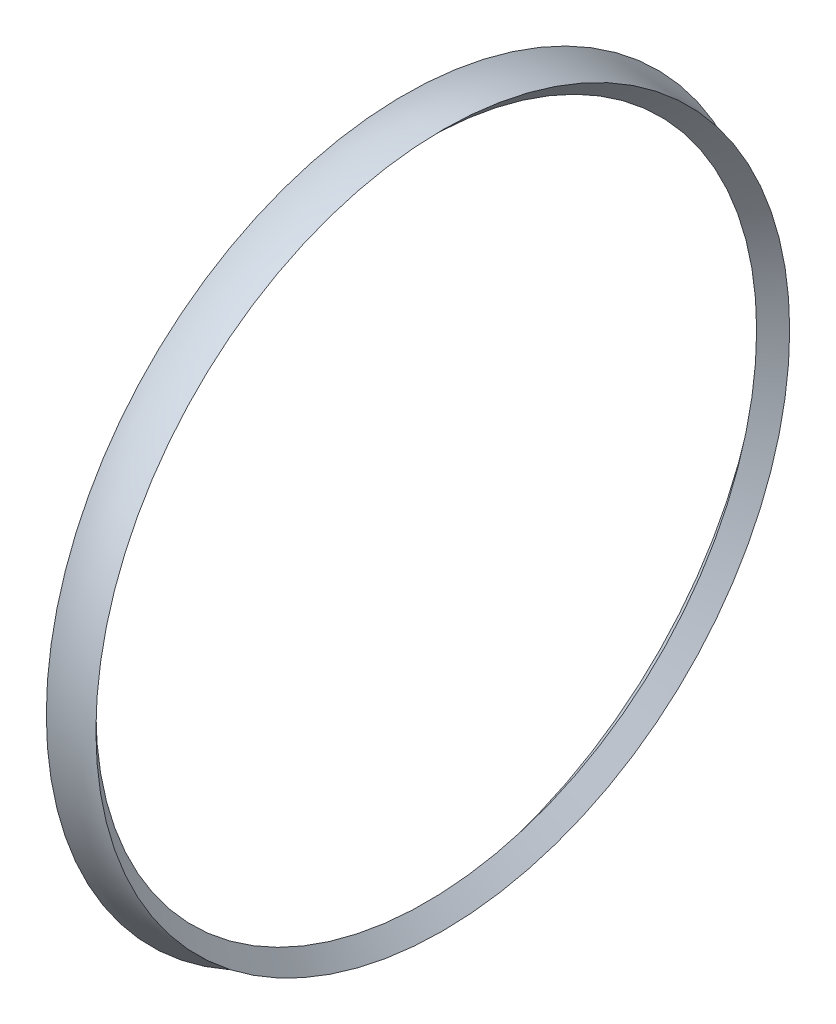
from build123d import *


with BuildPart() as part:
    # Esquisse1 → R_volution1 (revolve)
    with BuildSketch(Plane.XY, mode=Mode.PRIVATE) as r_volution1_sk:
        with BuildLine():
            Line((8.5, 31.5), (7, 30))
            Line((7, 30), (7, 30.5))
            Line((7, 30.5), (5, 32.5))
            ThreePointArc((5, 32.5), (6.679972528, 31.754903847), (8.5, 31.5))
        make_face()
    revolve(r_volution1_sk.sketch.rotate(Axis((0, 0, 0), (1, 0, 0)), 90), axis=Axis((0, 0, 0), (1, 0, 0)))


solid = part.part
